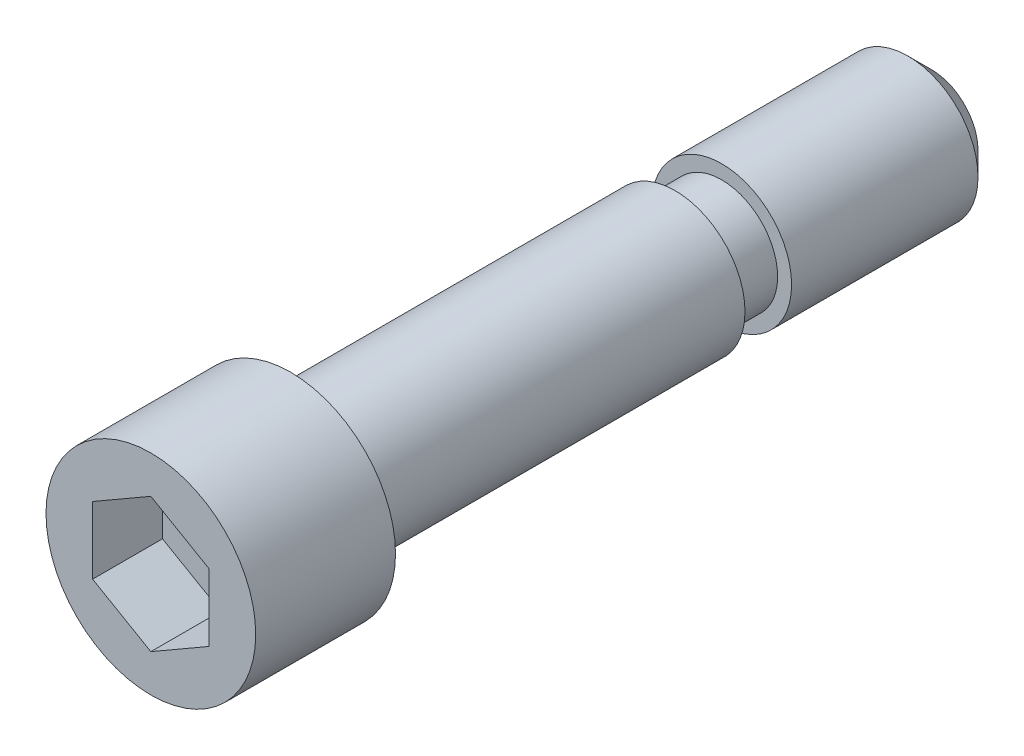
ISO-10303-21;
HEADER;
FILE_DESCRIPTION(('STEP AP214'),'2;1');
FILE_NAME('part.step','',(''),(''),'','','');
FILE_SCHEMA(('AUTOMOTIVE_DESIGN { 1 0 10303 214 1 1 1 1 }'));
ENDSEC;
DATA;
#1=APPLICATION_CONTEXT('core data for automotive mechanical design processes');
#2=APPLICATION_PROTOCOL_DEFINITION('international standard','automotive_design',2000,#1);
#3=PRODUCT_CONTEXT('',#1,'mechanical');
#4=PRODUCT('Part','Part','',(#3));
#5=PRODUCT_RELATED_PRODUCT_CATEGORY('part','',(#4));
#6=PRODUCT_DEFINITION_FORMATION('','',#4);
#7=PRODUCT_DEFINITION_CONTEXT('part definition',#1,'design');
#8=PRODUCT_DEFINITION('design','',#6,#7);
#9=PRODUCT_DEFINITION_SHAPE('','',#8);
#10=(LENGTH_UNIT() NAMED_UNIT(*) SI_UNIT(.MILLI.,.METRE.));
#11=(NAMED_UNIT(*) PLANE_ANGLE_UNIT() SI_UNIT($,.RADIAN.));
#12=(NAMED_UNIT(*) SI_UNIT($,.STERADIAN.) SOLID_ANGLE_UNIT());
#13=UNCERTAINTY_MEASURE_WITH_UNIT(LENGTH_MEASURE(1.E-05),#10,'distance_accuracy_value','');
#14=(GEOMETRIC_REPRESENTATION_CONTEXT(3) GLOBAL_UNCERTAINTY_ASSIGNED_CONTEXT((#13)) GLOBAL_UNIT_ASSIGNED_CONTEXT((#10,
#11,#12)) REPRESENTATION_CONTEXT('',''));
#15=CARTESIAN_POINT('',(0.,0.,0.));
#16=DIRECTION('',(0.,0.,1.));
#17=DIRECTION('',(1.,0.,0.));
#18=AXIS2_PLACEMENT_3D('',#15,#16,#17);
#19=CARTESIAN_POINT('',(0.,0.,-55.));
#20=DIRECTION('',(0.,0.,1.));
#21=DIRECTION('',(1.,0.,0.));
#22=AXIS2_PLACEMENT_3D('',#19,#20,#21);
#23=PLANE('',#22);
#24=CARTESIAN_POINT('',(0.,0.,-55.));
#25=DIRECTION('',(0.,0.,1.));
#26=DIRECTION('',(1.,0.,0.));
#27=AXIS2_PLACEMENT_3D('',#24,#25,#26);
#28=CIRCLE('',#27,4.);
#29=CARTESIAN_POINT('',(4.,0.,-55.));
#30=VERTEX_POINT('',#29);
#31=EDGE_CURVE('E9',#30,#30,#28,.T.);
#32=ORIENTED_EDGE('',*,*,#31,.F.);
#33=EDGE_LOOP('',(#32));
#34=FACE_BOUND('',#33,.T.);
#35=ADVANCED_FACE('F14',(#34),#23,.F.);
#36=CARTESIAN_POINT('',(0.,0.,-55.));
#37=DIRECTION('',(0.,0.,1.));
#38=DIRECTION('',(1.,0.,0.));
#39=AXIS2_PLACEMENT_3D('',#36,#37,#38);
#40=CONICAL_SURFACE('',#39,4.,0.785398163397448);
#41=CARTESIAN_POINT('',(0.,0.,-53.));
#42=DIRECTION('',(0.,0.,1.));
#43=DIRECTION('',(1.,0.,0.));
#44=AXIS2_PLACEMENT_3D('',#41,#42,#43);
#45=CIRCLE('',#44,6.);
#46=CARTESIAN_POINT('',(6.,0.,-53.));
#47=VERTEX_POINT('',#46);
#48=EDGE_CURVE('E21',#47,#47,#45,.T.);
#49=ORIENTED_EDGE('',*,*,#48,.F.);
#50=EDGE_LOOP('',(#49));
#51=FACE_BOUND('',#50,.T.);
#52=ORIENTED_EDGE('',*,*,#31,.T.);
#53=EDGE_LOOP('',(#52));
#54=FACE_BOUND('',#53,.T.);
#55=ADVANCED_FACE('F147',(#51,#54),#40,.T.);
#56=CARTESIAN_POINT('',(0.,0.,25.));
#57=DIRECTION('',(0.,0.,1.));
#58=DIRECTION('',(1.,0.,0.));
#59=AXIS2_PLACEMENT_3D('',#56,#57,#58);
#60=CYLINDRICAL_SURFACE('',#59,6.);
#61=CARTESIAN_POINT('',(0.,0.,-37.));
#62=DIRECTION('',(0.,0.,1.));
#63=DIRECTION('',(1.,0.,0.));
#64=AXIS2_PLACEMENT_3D('',#61,#62,#63);
#65=CIRCLE('',#64,6.);
#66=CARTESIAN_POINT('',(6.,0.,-37.));
#67=VERTEX_POINT('',#66);
#68=EDGE_CURVE('E140',#67,#67,#65,.T.);
#69=ORIENTED_EDGE('',*,*,#68,.F.);
#70=EDGE_LOOP('',(#69));
#71=FACE_BOUND('',#70,.T.);
#72=ORIENTED_EDGE('',*,*,#48,.T.);
#73=EDGE_LOOP('',(#72));
#74=FACE_BOUND('',#73,.T.);
#75=ADVANCED_FACE('F145',(#71,#74),#60,.T.);
#76=CARTESIAN_POINT('',(-6.,0.,-37.));
#77=DIRECTION('',(0.,0.,-1.));
#78=DIRECTION('',(-1.,0.,0.));
#79=AXIS2_PLACEMENT_3D('',#76,#77,#78);
#80=PLANE('',#79);
#81=CARTESIAN_POINT('',(0.,0.,-37.));
#82=DIRECTION('',(0.,0.,1.));
#83=DIRECTION('',(1.,0.,0.));
#84=AXIS2_PLACEMENT_3D('',#81,#82,#83);
#85=CIRCLE('',#84,4.8);
#86=CARTESIAN_POINT('',(4.8,0.,-37.));
#87=VERTEX_POINT('',#86);
#88=EDGE_CURVE('E137',#87,#87,#85,.T.);
#89=ORIENTED_EDGE('',*,*,#88,.F.);
#90=EDGE_LOOP('',(#89));
#91=FACE_BOUND('',#90,.T.);
#92=ORIENTED_EDGE('',*,*,#68,.T.);
#93=EDGE_LOOP('',(#92));
#94=FACE_BOUND('',#93,.T.);
#95=ADVANCED_FACE('F170',(#91,#94),#80,.F.);
#96=CARTESIAN_POINT('',(0.,0.,25.));
#97=DIRECTION('',(0.,0.,1.));
#98=DIRECTION('',(1.,0.,0.));
#99=AXIS2_PLACEMENT_3D('',#96,#97,#98);
#100=CYLINDRICAL_SURFACE('',#99,4.8);
#101=CARTESIAN_POINT('',(0.,0.,-33.));
#102=DIRECTION('',(0.,0.,1.));
#103=DIRECTION('',(1.,0.,0.));
#104=AXIS2_PLACEMENT_3D('',#101,#102,#103);
#105=CIRCLE('',#104,4.8);
#106=CARTESIAN_POINT('',(4.8,0.,-33.));
#107=VERTEX_POINT('',#106);
#108=EDGE_CURVE('E134',#107,#107,#105,.T.);
#109=ORIENTED_EDGE('',*,*,#108,.F.);
#110=EDGE_LOOP('',(#109));
#111=FACE_BOUND('',#110,.T.);
#112=ORIENTED_EDGE('',*,*,#88,.T.);
#113=EDGE_LOOP('',(#112));
#114=FACE_BOUND('',#113,.T.);
#115=ADVANCED_FACE('F179',(#111,#114),#100,.T.);
#116=CARTESIAN_POINT('',(-4.8,0.,-33.));
#117=DIRECTION('',(0.,0.,1.));
#118=DIRECTION('',(1.,0.,0.));
#119=AXIS2_PLACEMENT_3D('',#116,#117,#118);
#120=PLANE('',#119);
#121=CARTESIAN_POINT('',(0.,0.,-33.));
#122=DIRECTION('',(0.,0.,1.));
#123=DIRECTION('',(1.,0.,0.));
#124=AXIS2_PLACEMENT_3D('',#121,#122,#123);
#125=CIRCLE('',#124,6.);
#126=CARTESIAN_POINT('',(6.,0.,-33.));
#127=VERTEX_POINT('',#126);
#128=EDGE_CURVE('E131',#127,#127,#125,.T.);
#129=ORIENTED_EDGE('',*,*,#128,.F.);
#130=EDGE_LOOP('',(#129));
#131=FACE_BOUND('',#130,.T.);
#132=ORIENTED_EDGE('',*,*,#108,.T.);
#133=EDGE_LOOP('',(#132));
#134=FACE_BOUND('',#133,.T.);
#135=ADVANCED_FACE('F188',(#131,#134),#120,.F.);
#136=CARTESIAN_POINT('',(0.,0.,25.));
#137=DIRECTION('',(0.,0.,1.));
#138=DIRECTION('',(1.,0.,0.));
#139=AXIS2_PLACEMENT_3D('',#136,#137,#138);
#140=CYLINDRICAL_SURFACE('',#139,6.);
#141=CARTESIAN_POINT('',(0.,0.,0.));
#142=DIRECTION('',(0.,0.,1.));
#143=DIRECTION('',(1.,0.,0.));
#144=AXIS2_PLACEMENT_3D('',#141,#142,#143);
#145=CIRCLE('',#144,6.);
#146=CARTESIAN_POINT('',(6.,0.,0.));
#147=VERTEX_POINT('',#146);
#148=EDGE_CURVE('E128',#147,#147,#145,.T.);
#149=ORIENTED_EDGE('',*,*,#148,.F.);
#150=EDGE_LOOP('',(#149));
#151=FACE_BOUND('',#150,.T.);
#152=ORIENTED_EDGE('',*,*,#128,.T.);
#153=EDGE_LOOP('',(#152));
#154=FACE_BOUND('',#153,.T.);
#155=ADVANCED_FACE('F197',(#151,#154),#140,.T.);
#156=CARTESIAN_POINT('',(-6.,0.,0.));
#157=DIRECTION('',(0.,0.,1.));
#158=DIRECTION('',(1.,0.,0.));
#159=AXIS2_PLACEMENT_3D('',#156,#157,#158);
#160=PLANE('',#159);
#161=CARTESIAN_POINT('',(0.,0.,0.));
#162=DIRECTION('',(0.,0.,1.));
#163=DIRECTION('',(1.,0.,0.));
#164=AXIS2_PLACEMENT_3D('',#161,#162,#163);
#165=CIRCLE('',#164,9.);
#166=CARTESIAN_POINT('',(9.,0.,0.));
#167=VERTEX_POINT('',#166);
#168=EDGE_CURVE('E125',#167,#167,#165,.T.);
#169=ORIENTED_EDGE('',*,*,#168,.F.);
#170=EDGE_LOOP('',(#169));
#171=FACE_BOUND('',#170,.T.);
#172=ORIENTED_EDGE('',*,*,#148,.T.);
#173=EDGE_LOOP('',(#172));
#174=FACE_BOUND('',#173,.T.);
#175=ADVANCED_FACE('F206',(#171,#174),#160,.F.);
#176=CARTESIAN_POINT('',(0.,0.,25.));
#177=DIRECTION('',(0.,0.,1.));
#178=DIRECTION('',(1.,0.,0.));
#179=AXIS2_PLACEMENT_3D('',#176,#177,#178);
#180=CYLINDRICAL_SURFACE('',#179,9.);
#181=CARTESIAN_POINT('',(0.,0.,12.));
#182=DIRECTION('',(0.,0.,1.));
#183=DIRECTION('',(1.,0.,0.));
#184=AXIS2_PLACEMENT_3D('',#181,#182,#183);
#185=CIRCLE('',#184,9.);
#186=CARTESIAN_POINT('',(9.,0.,12.));
#187=VERTEX_POINT('',#186);
#188=EDGE_CURVE('E116',#187,#187,#185,.T.);
#189=ORIENTED_EDGE('',*,*,#188,.F.);
#190=EDGE_LOOP('',(#189));
#191=FACE_BOUND('',#190,.T.);
#192=ORIENTED_EDGE('',*,*,#168,.T.);
#193=EDGE_LOOP('',(#192));
#194=FACE_BOUND('',#193,.T.);
#195=ADVANCED_FACE('F215',(#191,#194),#180,.T.);
#196=CARTESIAN_POINT('',(-9.,0.,12.));
#197=DIRECTION('',(0.,0.,-1.));
#198=DIRECTION('',(-1.,0.,0.));
#199=AXIS2_PLACEMENT_3D('',#196,#197,#198);
#200=PLANE('',#199);
#201=DIRECTION('',(-0.866025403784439,-0.5,0.));
#202=VECTOR('',#201,1.);
#203=CARTESIAN_POINT('',(0.,5.77350269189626,12.));
#204=LINE('',#203,#202);
#205=CARTESIAN_POINT('',(0.,5.77350269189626,12.));
#206=VERTEX_POINT('',#205);
#207=CARTESIAN_POINT('',(-5.,2.88675134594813,12.));
#208=VERTEX_POINT('',#207);
#209=EDGE_CURVE('E82',#206,#208,#204,.T.);
#210=ORIENTED_EDGE('',*,*,#209,.F.);
#211=DIRECTION('',(-0.866025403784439,0.5,0.));
#212=VECTOR('',#211,1.);
#213=CARTESIAN_POINT('',(5.,2.88675134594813,12.));
#214=LINE('',#213,#212);
#215=CARTESIAN_POINT('',(5.,2.88675134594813,12.));
#216=VERTEX_POINT('',#215);
#217=EDGE_CURVE('E28',#216,#206,#214,.T.);
#218=ORIENTED_EDGE('',*,*,#217,.F.);
#219=DIRECTION('',(0.,1.,0.));
#220=VECTOR('',#219,1.);
#221=CARTESIAN_POINT('',(5.,-2.88675134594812,12.));
#222=LINE('',#221,#220);
#223=CARTESIAN_POINT('',(5.,-2.88675134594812,12.));
#224=VERTEX_POINT('',#223);
#225=EDGE_CURVE('E98',#224,#216,#222,.T.);
#226=ORIENTED_EDGE('',*,*,#225,.F.);
#227=DIRECTION('',(0.866025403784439,0.5,0.));
#228=VECTOR('',#227,1.);
#229=CARTESIAN_POINT('',(0.,-5.77350269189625,12.));
#230=LINE('',#229,#228);
#231=CARTESIAN_POINT('',(0.,-5.77350269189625,12.));
#232=VERTEX_POINT('',#231);
#233=EDGE_CURVE('E92',#232,#224,#230,.T.);
#234=ORIENTED_EDGE('',*,*,#233,.F.);
#235=DIRECTION('',(0.866025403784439,-0.5,0.));
#236=VECTOR('',#235,1.);
#237=CARTESIAN_POINT('',(-5.,-2.88675134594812,12.));
#238=LINE('',#237,#236);
#239=CARTESIAN_POINT('',(-5.,-2.88675134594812,12.));
#240=VERTEX_POINT('',#239);
#241=EDGE_CURVE('E90',#240,#232,#238,.T.);
#242=ORIENTED_EDGE('',*,*,#241,.F.);
#243=DIRECTION('',(0.,-1.,0.));
#244=VECTOR('',#243,1.);
#245=CARTESIAN_POINT('',(-5.,2.88675134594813,12.));
#246=LINE('',#245,#244);
#247=EDGE_CURVE('E71',#208,#240,#246,.T.);
#248=ORIENTED_EDGE('',*,*,#247,.F.);
#249=EDGE_LOOP('',(#210,#218,#226,#234,#242,#248));
#250=FACE_BOUND('',#249,.T.);
#251=ORIENTED_EDGE('',*,*,#188,.T.);
#252=EDGE_LOOP('',(#251));
#253=FACE_BOUND('',#252,.T.);
#254=ADVANCED_FACE('F86',(#250,#253),#200,.F.);
#255=CARTESIAN_POINT('',(5.,2.88675134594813,6.));
#256=DIRECTION('',(0.5,0.866025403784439,0.));
#257=DIRECTION('',(-0.866025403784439,0.5,0.));
#258=AXIS2_PLACEMENT_3D('',#255,#256,#257);
#259=PLANE('',#258);
#260=ORIENTED_EDGE('',*,*,#217,.T.);
#261=DIRECTION('',(0.,0.,1.));
#262=VECTOR('',#261,1.);
#263=CARTESIAN_POINT('',(0.,5.77350269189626,6.));
#264=LINE('',#263,#262);
#265=CARTESIAN_POINT('',(0.,5.77350269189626,6.));
#266=VERTEX_POINT('',#265);
#267=EDGE_CURVE('E79',#266,#206,#264,.T.);
#268=ORIENTED_EDGE('',*,*,#267,.F.);
#269=DIRECTION('',(-0.866025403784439,0.5,0.));
#270=VECTOR('',#269,1.);
#271=CARTESIAN_POINT('',(5.,2.88675134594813,6.));
#272=LINE('',#271,#270);
#273=CARTESIAN_POINT('',(5.,2.88675134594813,6.));
#274=VERTEX_POINT('',#273);
#275=EDGE_CURVE('E100',#274,#266,#272,.T.);
#276=ORIENTED_EDGE('',*,*,#275,.F.);
#277=DIRECTION('',(0.,0.,1.));
#278=VECTOR('',#277,1.);
#279=CARTESIAN_POINT('',(5.,2.88675134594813,6.));
#280=LINE('',#279,#278);
#281=EDGE_CURVE('E35',#274,#216,#280,.T.);
#282=ORIENTED_EDGE('',*,*,#281,.T.);
#283=EDGE_LOOP('',(#260,#268,#276,#282));
#284=FACE_BOUND('',#283,.T.);
#285=ADVANCED_FACE('F232',(#284),#259,.F.);
#286=CARTESIAN_POINT('',(5.,-2.88675134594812,6.));
#287=DIRECTION('',(1.,0.,0.));
#288=DIRECTION('',(0.,0.,-1.));
#289=AXIS2_PLACEMENT_3D('',#286,#287,#288);
#290=PLANE('',#289);
#291=ORIENTED_EDGE('',*,*,#225,.T.);
#292=ORIENTED_EDGE('',*,*,#281,.F.);
#293=DIRECTION('',(0.,1.,0.));
#294=VECTOR('',#293,1.);
#295=CARTESIAN_POINT('',(5.,-2.88675134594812,6.));
#296=LINE('',#295,#294);
#297=CARTESIAN_POINT('',(5.,-2.88675134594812,6.));
#298=VERTEX_POINT('',#297);
#299=EDGE_CURVE('E112',#298,#274,#296,.T.);
#300=ORIENTED_EDGE('',*,*,#299,.F.);
#301=DIRECTION('',(0.,0.,1.));
#302=VECTOR('',#301,1.);
#303=CARTESIAN_POINT('',(5.,-2.88675134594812,6.));
#304=LINE('',#303,#302);
#305=EDGE_CURVE('E117',#298,#224,#304,.T.);
#306=ORIENTED_EDGE('',*,*,#305,.T.);
#307=EDGE_LOOP('',(#291,#292,#300,#306));
#308=FACE_BOUND('',#307,.T.);
#309=ADVANCED_FACE('F240',(#308),#290,.F.);
#310=CARTESIAN_POINT('',(0.,-5.77350269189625,6.));
#311=DIRECTION('',(0.5,-0.866025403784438,0.));
#312=DIRECTION('',(0.866025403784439,0.5,0.));
#313=AXIS2_PLACEMENT_3D('',#310,#311,#312);
#314=PLANE('',#313);
#315=ORIENTED_EDGE('',*,*,#233,.T.);
#316=ORIENTED_EDGE('',*,*,#305,.F.);
#317=DIRECTION('',(0.866025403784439,0.5,0.));
#318=VECTOR('',#317,1.);
#319=CARTESIAN_POINT('',(0.,-5.77350269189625,6.));
#320=LINE('',#319,#318);
#321=CARTESIAN_POINT('',(0.,-5.77350269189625,6.));
#322=VERTEX_POINT('',#321);
#323=EDGE_CURVE('E109',#322,#298,#320,.T.);
#324=ORIENTED_EDGE('',*,*,#323,.F.);
#325=DIRECTION('',(0.,0.,1.));
#326=VECTOR('',#325,1.);
#327=CARTESIAN_POINT('',(0.,-5.77350269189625,6.));
#328=LINE('',#327,#326);
#329=EDGE_CURVE('E119',#322,#232,#328,.T.);
#330=ORIENTED_EDGE('',*,*,#329,.T.);
#331=EDGE_LOOP('',(#315,#316,#324,#330));
#332=FACE_BOUND('',#331,.T.);
#333=ADVANCED_FACE('F248',(#332),#314,.F.);
#334=CARTESIAN_POINT('',(-5.,-2.88675134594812,6.));
#335=DIRECTION('',(-0.5,-0.866025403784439,0.));
#336=DIRECTION('',(0.866025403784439,-0.5,0.));
#337=AXIS2_PLACEMENT_3D('',#334,#335,#336);
#338=PLANE('',#337);
#339=ORIENTED_EDGE('',*,*,#241,.T.);
#340=ORIENTED_EDGE('',*,*,#329,.F.);
#341=DIRECTION('',(0.866025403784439,-0.5,0.));
#342=VECTOR('',#341,1.);
#343=CARTESIAN_POINT('',(-5.,-2.88675134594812,6.));
#344=LINE('',#343,#342);
#345=CARTESIAN_POINT('',(-5.,-2.88675134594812,6.));
#346=VERTEX_POINT('',#345);
#347=EDGE_CURVE('E106',#346,#322,#344,.T.);
#348=ORIENTED_EDGE('',*,*,#347,.F.);
#349=DIRECTION('',(0.,0.,1.));
#350=VECTOR('',#349,1.);
#351=CARTESIAN_POINT('',(-5.,-2.88675134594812,6.));
#352=LINE('',#351,#350);
#353=EDGE_CURVE('E78',#346,#240,#352,.T.);
#354=ORIENTED_EDGE('',*,*,#353,.T.);
#355=EDGE_LOOP('',(#339,#340,#348,#354));
#356=FACE_BOUND('',#355,.T.);
#357=ADVANCED_FACE('F256',(#356),#338,.F.);
#358=CARTESIAN_POINT('',(-5.,2.88675134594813,6.));
#359=DIRECTION('',(-1.,0.,0.));
#360=DIRECTION('',(0.,0.,1.));
#361=AXIS2_PLACEMENT_3D('',#358,#359,#360);
#362=PLANE('',#361);
#363=ORIENTED_EDGE('',*,*,#247,.T.);
#364=ORIENTED_EDGE('',*,*,#353,.F.);
#365=DIRECTION('',(0.,-1.,0.));
#366=VECTOR('',#365,1.);
#367=CARTESIAN_POINT('',(-5.,2.88675134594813,6.));
#368=LINE('',#367,#366);
#369=CARTESIAN_POINT('',(-5.,2.88675134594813,6.));
#370=VERTEX_POINT('',#369);
#371=EDGE_CURVE('E74',#370,#346,#368,.T.);
#372=ORIENTED_EDGE('',*,*,#371,.F.);
#373=DIRECTION('',(0.,0.,1.));
#374=VECTOR('',#373,1.);
#375=CARTESIAN_POINT('',(-5.,2.88675134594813,6.));
#376=LINE('',#375,#374);
#377=EDGE_CURVE('E67',#370,#208,#376,.T.);
#378=ORIENTED_EDGE('',*,*,#377,.T.);
#379=EDGE_LOOP('',(#363,#364,#372,#378));
#380=FACE_BOUND('',#379,.T.);
#381=ADVANCED_FACE('F69',(#380),#362,.F.);
#382=CARTESIAN_POINT('',(0.,5.77350269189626,6.));
#383=DIRECTION('',(-0.5,0.866025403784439,0.));
#384=DIRECTION('',(-0.866025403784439,-0.5,0.));
#385=AXIS2_PLACEMENT_3D('',#382,#383,#384);
#386=PLANE('',#385);
#387=ORIENTED_EDGE('',*,*,#209,.T.);
#388=ORIENTED_EDGE('',*,*,#377,.F.);
#389=DIRECTION('',(-0.866025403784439,-0.5,0.));
#390=VECTOR('',#389,1.);
#391=CARTESIAN_POINT('',(0.,5.77350269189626,6.));
#392=LINE('',#391,#390);
#393=EDGE_CURVE('E103',#266,#370,#392,.T.);
#394=ORIENTED_EDGE('',*,*,#393,.F.);
#395=ORIENTED_EDGE('',*,*,#267,.T.);
#396=EDGE_LOOP('',(#387,#388,#394,#395));
#397=FACE_BOUND('',#396,.T.);
#398=ADVANCED_FACE('F83',(#397),#386,.F.);
#399=CARTESIAN_POINT('',(5.,2.88675134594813,6.));
#400=DIRECTION('',(0.,0.,-1.));
#401=DIRECTION('',(-1.,0.,0.));
#402=AXIS2_PLACEMENT_3D('',#399,#400,#401);
#403=PLANE('',#402);
#404=ORIENTED_EDGE('',*,*,#275,.T.);
#405=ORIENTED_EDGE('',*,*,#393,.T.);
#406=ORIENTED_EDGE('',*,*,#371,.T.);
#407=ORIENTED_EDGE('',*,*,#347,.T.);
#408=ORIENTED_EDGE('',*,*,#323,.T.);
#409=ORIENTED_EDGE('',*,*,#299,.T.);
#410=EDGE_LOOP('',(#404,#405,#406,#407,#408,#409));
#411=FACE_BOUND('',#410,.T.);
#412=ADVANCED_FACE('F280',(#411),#403,.F.);
#413=CLOSED_SHELL('',(#35,#55,#75,#95,#115,#135,#155,#175,#195,#254,#285,#309,#333,#357,#381,
#398,#412));
#414=MANIFOLD_SOLID_BREP('B1',#413);
#415=ADVANCED_BREP_SHAPE_REPRESENTATION('',(#18,#414),#14);
#416=SHAPE_DEFINITION_REPRESENTATION(#9,#415);
ENDSEC;
END-ISO-10303-21;
